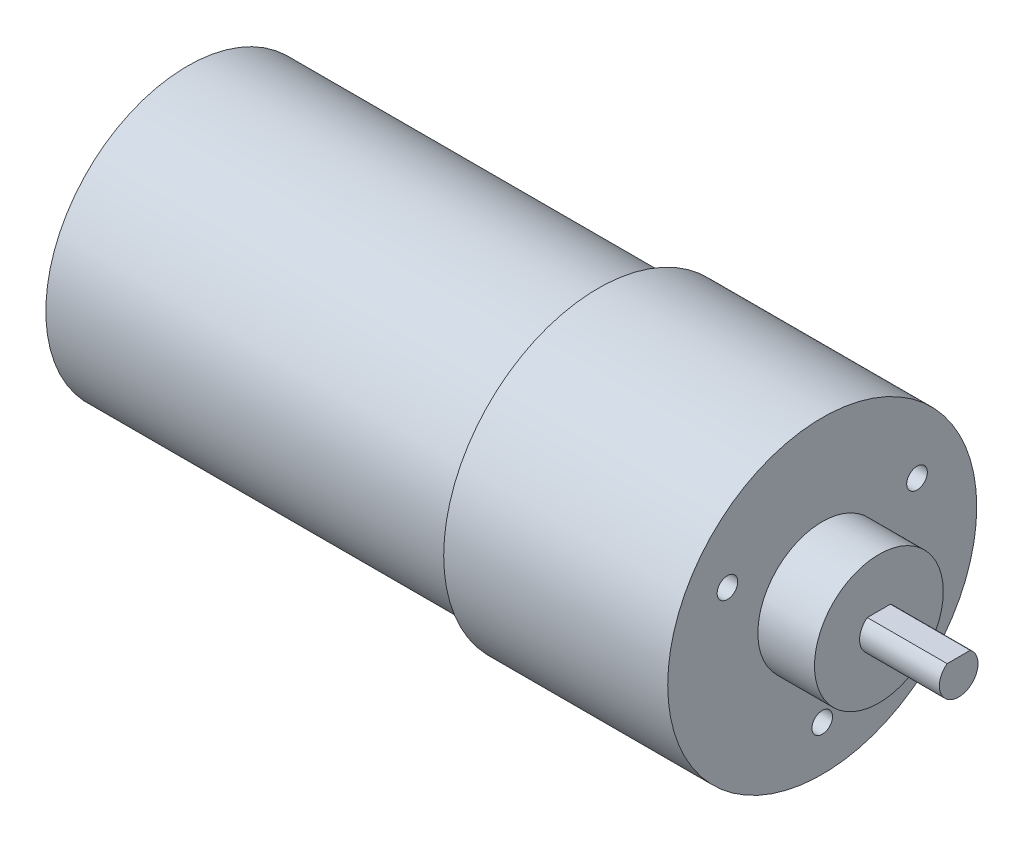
ISO-10303-21;
HEADER;
FILE_DESCRIPTION(('STEP AP214'),'2;1');
FILE_NAME('part.step','',(''),(''),'','','');
FILE_SCHEMA(('AUTOMOTIVE_DESIGN { 1 0 10303 214 1 1 1 1 }'));
ENDSEC;
DATA;
#1=APPLICATION_CONTEXT('core data for automotive mechanical design processes');
#2=APPLICATION_PROTOCOL_DEFINITION('international standard','automotive_design',2000,#1);
#3=PRODUCT_CONTEXT('',#1,'mechanical');
#4=PRODUCT('Part','Part','',(#3));
#5=PRODUCT_RELATED_PRODUCT_CATEGORY('part','',(#4));
#6=PRODUCT_DEFINITION_FORMATION('','',#4);
#7=PRODUCT_DEFINITION_CONTEXT('part definition',#1,'design');
#8=PRODUCT_DEFINITION('design','',#6,#7);
#9=PRODUCT_DEFINITION_SHAPE('','',#8);
#10=(LENGTH_UNIT() NAMED_UNIT(*) SI_UNIT(.MILLI.,.METRE.));
#11=(NAMED_UNIT(*) PLANE_ANGLE_UNIT() SI_UNIT($,.RADIAN.));
#12=(NAMED_UNIT(*) SI_UNIT($,.STERADIAN.) SOLID_ANGLE_UNIT());
#13=UNCERTAINTY_MEASURE_WITH_UNIT(LENGTH_MEASURE(1.E-05),#10,'distance_accuracy_value','');
#14=(GEOMETRIC_REPRESENTATION_CONTEXT(3) GLOBAL_UNCERTAINTY_ASSIGNED_CONTEXT((#13)) GLOBAL_UNIT_ASSIGNED_CONTEXT((#10,
#11,#12)) REPRESENTATION_CONTEXT('',''));
#15=CARTESIAN_POINT('',(0.,0.,0.));
#16=DIRECTION('',(0.,0.,1.));
#17=DIRECTION('',(1.,0.,0.));
#18=AXIS2_PLACEMENT_3D('',#15,#16,#17);
#19=CARTESIAN_POINT('',(53.7,0.,0.));
#20=DIRECTION('',(1.,0.,0.));
#21=DIRECTION('',(0.,0.,-1.));
#22=AXIS2_PLACEMENT_3D('',#19,#20,#21);
#23=PLANE('',#22);
#24=CARTESIAN_POINT('',(53.7,0.,0.));
#25=DIRECTION('',(1.,0.,0.));
#26=DIRECTION('',(0.,0.,-1.));
#27=AXIS2_PLACEMENT_3D('',#24,#25,#26);
#28=CIRCLE('',#27,5.);
#29=CARTESIAN_POINT('',(53.7,0.,-5.));
#30=VERTEX_POINT('',#29);
#31=EDGE_CURVE('E81',#30,#30,#28,.T.);
#32=ORIENTED_EDGE('',*,*,#31,.T.);
#33=EDGE_LOOP('',(#32));
#34=FACE_BOUND('',#33,.T.);
#35=DIRECTION('',(0.,0.,1.));
#36=VECTOR('',#35,1.);
#37=CARTESIAN_POINT('',(53.7,1.2,0.9));
#38=LINE('',#37,#36);
#39=CARTESIAN_POINT('',(53.7,1.2,-0.9));
#40=VERTEX_POINT('',#39);
#41=CARTESIAN_POINT('',(53.7,1.2,0.9));
#42=VERTEX_POINT('',#41);
#43=EDGE_CURVE('E61',#40,#42,#38,.T.);
#44=ORIENTED_EDGE('',*,*,#43,.F.);
#45=CARTESIAN_POINT('',(53.7,0.,0.));
#46=DIRECTION('',(1.,0.,0.));
#47=DIRECTION('',(0.,0.,-1.));
#48=AXIS2_PLACEMENT_3D('',#45,#46,#47);
#49=CIRCLE('',#48,1.5);
#50=EDGE_CURVE('E46',#42,#40,#49,.T.);
#51=ORIENTED_EDGE('',*,*,#50,.F.);
#52=EDGE_LOOP('',(#44,#51));
#53=FACE_BOUND('',#52,.T.);
#54=ADVANCED_FACE('F31',(#34,#53),#23,.T.);
#55=CARTESIAN_POINT('',(49.3,0.,0.));
#56=DIRECTION('',(1.,0.,0.));
#57=DIRECTION('',(0.,0.,-1.));
#58=AXIS2_PLACEMENT_3D('',#55,#56,#57);
#59=PLANE('',#58);
#60=CARTESIAN_POINT('',(49.3,4.24999999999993,-7.36121593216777));
#61=DIRECTION('',(1.,0.,0.));
#62=DIRECTION('',(0.,0.,-1.));
#63=AXIS2_PLACEMENT_3D('',#60,#61,#62);
#64=CIRCLE('',#63,0.8);
#65=CARTESIAN_POINT('',(49.3,4.24999999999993,-8.16121593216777));
#66=VERTEX_POINT('',#65);
#67=EDGE_CURVE('E258',#66,#66,#64,.T.);
#68=ORIENTED_EDGE('',*,*,#67,.F.);
#69=EDGE_LOOP('',(#68));
#70=FACE_BOUND('',#69,.T.);
#71=CARTESIAN_POINT('',(49.3,4.25000000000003,7.36121593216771));
#72=DIRECTION('',(1.,0.,0.));
#73=DIRECTION('',(0.,0.,-1.));
#74=AXIS2_PLACEMENT_3D('',#71,#72,#73);
#75=CIRCLE('',#74,0.8);
#76=CARTESIAN_POINT('',(49.3,4.25000000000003,6.56121593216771));
#77=VERTEX_POINT('',#76);
#78=EDGE_CURVE('E257',#77,#77,#75,.T.);
#79=ORIENTED_EDGE('',*,*,#78,.F.);
#80=EDGE_LOOP('',(#79));
#81=FACE_BOUND('',#80,.T.);
#82=CARTESIAN_POINT('',(49.3,-8.5,0.));
#83=DIRECTION('',(1.,0.,0.));
#84=DIRECTION('',(0.,0.,-1.));
#85=AXIS2_PLACEMENT_3D('',#82,#83,#84);
#86=CIRCLE('',#85,0.8);
#87=CARTESIAN_POINT('',(49.3,-8.5,-0.8));
#88=VERTEX_POINT('',#87);
#89=EDGE_CURVE('E74',#88,#88,#86,.T.);
#90=ORIENTED_EDGE('',*,*,#89,.F.);
#91=EDGE_LOOP('',(#90));
#92=FACE_BOUND('',#91,.T.);
#93=CARTESIAN_POINT('',(49.3,0.,0.));
#94=DIRECTION('',(1.,0.,0.));
#95=DIRECTION('',(0.,0.,-1.));
#96=AXIS2_PLACEMENT_3D('',#93,#94,#95);
#97=CIRCLE('',#96,12.);
#98=CARTESIAN_POINT('',(49.3,0.,-12.));
#99=VERTEX_POINT('',#98);
#100=EDGE_CURVE('E87',#99,#99,#97,.T.);
#101=ORIENTED_EDGE('',*,*,#100,.T.);
#102=EDGE_LOOP('',(#101));
#103=FACE_BOUND('',#102,.T.);
#104=CARTESIAN_POINT('',(49.3,0.,0.));
#105=DIRECTION('',(1.,0.,0.));
#106=DIRECTION('',(0.,0.,-1.));
#107=AXIS2_PLACEMENT_3D('',#104,#105,#106);
#108=CIRCLE('',#107,5.);
#109=CARTESIAN_POINT('',(49.3,0.,-5.));
#110=VERTEX_POINT('',#109);
#111=EDGE_CURVE('E80',#110,#110,#108,.T.);
#112=ORIENTED_EDGE('',*,*,#111,.F.);
#113=EDGE_LOOP('',(#112));
#114=FACE_BOUND('',#113,.T.);
#115=ADVANCED_FACE('F104',(#70,#81,#92,#103,#114),#59,.T.);
#116=CARTESIAN_POINT('',(31.9,0.,0.));
#117=DIRECTION('',(-1.,0.,0.));
#118=DIRECTION('',(0.,0.,1.));
#119=AXIS2_PLACEMENT_3D('',#116,#117,#118);
#120=CYLINDRICAL_SURFACE('',#119,11.);
#121=CARTESIAN_POINT('',(31.9,0.,0.));
#122=DIRECTION('',(1.,0.,0.));
#123=DIRECTION('',(0.,0.,-1.));
#124=AXIS2_PLACEMENT_3D('',#121,#122,#123);
#125=CIRCLE('',#124,11.);
#126=CARTESIAN_POINT('',(31.9,0.,-11.));
#127=VERTEX_POINT('',#126);
#128=EDGE_CURVE('E11',#127,#127,#125,.T.);
#129=ORIENTED_EDGE('',*,*,#128,.F.);
#130=EDGE_LOOP('',(#129));
#131=FACE_BOUND('',#130,.T.);
#132=CARTESIAN_POINT('',(0.,0.,0.));
#133=DIRECTION('',(1.,0.,0.));
#134=DIRECTION('',(0.,0.,-1.));
#135=AXIS2_PLACEMENT_3D('',#132,#133,#134);
#136=CIRCLE('',#135,11.);
#137=CARTESIAN_POINT('',(0.,0.,-11.));
#138=VERTEX_POINT('',#137);
#139=EDGE_CURVE('E35',#138,#138,#136,.T.);
#140=ORIENTED_EDGE('',*,*,#139,.T.);
#141=EDGE_LOOP('',(#140));
#142=FACE_BOUND('',#141,.T.);
#143=ADVANCED_FACE('F33',(#131,#142),#120,.T.);
#144=CARTESIAN_POINT('',(0.,0.,0.));
#145=DIRECTION('',(1.,0.,0.));
#146=DIRECTION('',(0.,0.,-1.));
#147=AXIS2_PLACEMENT_3D('',#144,#145,#146);
#148=PLANE('',#147);
#149=ORIENTED_EDGE('',*,*,#139,.F.);
#150=EDGE_LOOP('',(#149));
#151=FACE_BOUND('',#150,.T.);
#152=ADVANCED_FACE('F98',(#151),#148,.F.);
#153=CARTESIAN_POINT('',(31.9,0.,0.));
#154=DIRECTION('',(1.,0.,0.));
#155=DIRECTION('',(0.,0.,-1.));
#156=AXIS2_PLACEMENT_3D('',#153,#154,#155);
#157=PLANE('',#156);
#158=CARTESIAN_POINT('',(31.9,0.,0.));
#159=DIRECTION('',(1.,0.,0.));
#160=DIRECTION('',(0.,0.,-1.));
#161=AXIS2_PLACEMENT_3D('',#158,#159,#160);
#162=CIRCLE('',#161,12.);
#163=CARTESIAN_POINT('',(31.9,0.,-12.));
#164=VERTEX_POINT('',#163);
#165=EDGE_CURVE('E84',#164,#164,#162,.T.);
#166=ORIENTED_EDGE('',*,*,#165,.F.);
#167=EDGE_LOOP('',(#166));
#168=FACE_BOUND('',#167,.T.);
#169=ORIENTED_EDGE('',*,*,#128,.T.);
#170=EDGE_LOOP('',(#169));
#171=FACE_BOUND('',#170,.T.);
#172=ADVANCED_FACE('F95',(#168,#171),#157,.F.);
#173=CARTESIAN_POINT('',(49.3,0.,0.));
#174=DIRECTION('',(-1.,0.,0.));
#175=DIRECTION('',(0.,0.,1.));
#176=AXIS2_PLACEMENT_3D('',#173,#174,#175);
#177=CYLINDRICAL_SURFACE('',#176,12.);
#178=ORIENTED_EDGE('',*,*,#100,.F.);
#179=EDGE_LOOP('',(#178));
#180=FACE_BOUND('',#179,.T.);
#181=ORIENTED_EDGE('',*,*,#165,.T.);
#182=EDGE_LOOP('',(#181));
#183=FACE_BOUND('',#182,.T.);
#184=ADVANCED_FACE('F93',(#180,#183),#177,.T.);
#185=CARTESIAN_POINT('',(53.7,0.,0.));
#186=DIRECTION('',(-1.,0.,0.));
#187=DIRECTION('',(0.,0.,1.));
#188=AXIS2_PLACEMENT_3D('',#185,#186,#187);
#189=CYLINDRICAL_SURFACE('',#188,5.);
#190=ORIENTED_EDGE('',*,*,#31,.F.);
#191=EDGE_LOOP('',(#190));
#192=FACE_BOUND('',#191,.T.);
#193=ORIENTED_EDGE('',*,*,#111,.T.);
#194=EDGE_LOOP('',(#193));
#195=FACE_BOUND('',#194,.T.);
#196=ADVANCED_FACE('F123',(#192,#195),#189,.T.);
#197=CARTESIAN_POINT('',(59.9,0.,0.));
#198=DIRECTION('',(-1.,0.,0.));
#199=DIRECTION('',(0.,0.,1.));
#200=AXIS2_PLACEMENT_3D('',#197,#198,#199);
#201=CYLINDRICAL_SURFACE('',#200,1.5);
#202=ORIENTED_EDGE('',*,*,#50,.T.);
#203=DIRECTION('',(-1.,0.,0.));
#204=VECTOR('',#203,1.);
#205=CARTESIAN_POINT('',(59.9,1.2,-0.9));
#206=LINE('',#205,#204);
#207=CARTESIAN_POINT('',(59.9,1.2,-0.9));
#208=VERTEX_POINT('',#207);
#209=EDGE_CURVE('E65',#208,#40,#206,.T.);
#210=ORIENTED_EDGE('',*,*,#209,.F.);
#211=CARTESIAN_POINT('',(59.9,0.,0.));
#212=DIRECTION('',(1.,0.,0.));
#213=DIRECTION('',(0.,0.,-1.));
#214=AXIS2_PLACEMENT_3D('',#211,#212,#213);
#215=CIRCLE('',#214,1.5);
#216=CARTESIAN_POINT('',(59.9,1.2,0.9));
#217=VERTEX_POINT('',#216);
#218=EDGE_CURVE('E67',#217,#208,#215,.T.);
#219=ORIENTED_EDGE('',*,*,#218,.F.);
#220=DIRECTION('',(-1.,0.,0.));
#221=VECTOR('',#220,1.);
#222=CARTESIAN_POINT('',(59.9,1.2,0.9));
#223=LINE('',#222,#221);
#224=EDGE_CURVE('E63',#217,#42,#223,.T.);
#225=ORIENTED_EDGE('',*,*,#224,.T.);
#226=EDGE_LOOP('',(#202,#210,#219,#225));
#227=FACE_BOUND('',#226,.T.);
#228=ADVANCED_FACE('F69',(#227),#201,.T.);
#229=CARTESIAN_POINT('',(59.9,1.2,0.9));
#230=DIRECTION('',(0.,-1.,0.));
#231=DIRECTION('',(0.,0.,-1.));
#232=AXIS2_PLACEMENT_3D('',#229,#230,#231);
#233=PLANE('',#232);
#234=ORIENTED_EDGE('',*,*,#43,.T.);
#235=ORIENTED_EDGE('',*,*,#224,.F.);
#236=DIRECTION('',(0.,0.,1.));
#237=VECTOR('',#236,1.);
#238=CARTESIAN_POINT('',(59.9,1.2,0.9));
#239=LINE('',#238,#237);
#240=EDGE_CURVE('E54',#208,#217,#239,.T.);
#241=ORIENTED_EDGE('',*,*,#240,.F.);
#242=ORIENTED_EDGE('',*,*,#209,.T.);
#243=EDGE_LOOP('',(#234,#235,#241,#242));
#244=FACE_BOUND('',#243,.T.);
#245=ADVANCED_FACE('F62',(#244),#233,.F.);
#246=CARTESIAN_POINT('',(59.9,0.,0.));
#247=DIRECTION('',(1.,0.,0.));
#248=DIRECTION('',(0.,0.,-1.));
#249=AXIS2_PLACEMENT_3D('',#246,#247,#248);
#250=PLANE('',#249);
#251=ORIENTED_EDGE('',*,*,#218,.T.);
#252=ORIENTED_EDGE('',*,*,#240,.T.);
#253=EDGE_LOOP('',(#251,#252));
#254=FACE_BOUND('',#253,.T.);
#255=ADVANCED_FACE('F152',(#254),#250,.T.);
#256=CARTESIAN_POINT('',(47.8,-8.5,0.));
#257=DIRECTION('',(1.,0.,0.));
#258=DIRECTION('',(0.,0.,-1.));
#259=AXIS2_PLACEMENT_3D('',#256,#257,#258);
#260=CYLINDRICAL_SURFACE('',#259,0.8);
#261=CARTESIAN_POINT('',(47.8,-8.5,0.));
#262=DIRECTION('',(1.,0.,0.));
#263=DIRECTION('',(0.,0.,-1.));
#264=AXIS2_PLACEMENT_3D('',#261,#262,#263);
#265=CIRCLE('',#264,0.8);
#266=CARTESIAN_POINT('',(47.8,-8.5,-0.8));
#267=VERTEX_POINT('',#266);
#268=EDGE_CURVE('E71',#267,#267,#265,.T.);
#269=ORIENTED_EDGE('',*,*,#268,.F.);
#270=EDGE_LOOP('',(#269));
#271=FACE_BOUND('',#270,.T.);
#272=ORIENTED_EDGE('',*,*,#89,.T.);
#273=EDGE_LOOP('',(#272));
#274=FACE_BOUND('',#273,.T.);
#275=ADVANCED_FACE('F158',(#271,#274),#260,.F.);
#276=CARTESIAN_POINT('',(47.8,-8.5,0.));
#277=DIRECTION('',(1.,0.,0.));
#278=DIRECTION('',(0.,0.,-1.));
#279=AXIS2_PLACEMENT_3D('',#276,#277,#278);
#280=PLANE('',#279);
#281=ORIENTED_EDGE('',*,*,#268,.T.);
#282=EDGE_LOOP('',(#281));
#283=FACE_BOUND('',#282,.T.);
#284=ADVANCED_FACE('F166',(#283),#280,.T.);
#285=CARTESIAN_POINT('',(47.8,4.25000000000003,7.36121593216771));
#286=DIRECTION('',(1.,0.,0.));
#287=DIRECTION('',(0.,0.,-1.));
#288=AXIS2_PLACEMENT_3D('',#285,#286,#287);
#289=CYLINDRICAL_SURFACE('',#288,0.8);
#290=CARTESIAN_POINT('',(47.8,4.25000000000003,7.36121593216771));
#291=DIRECTION('',(1.,0.,0.));
#292=DIRECTION('',(0.,0.,-1.));
#293=AXIS2_PLACEMENT_3D('',#290,#291,#292);
#294=CIRCLE('',#293,0.8);
#295=CARTESIAN_POINT('',(47.8,4.25000000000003,6.56121593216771));
#296=VERTEX_POINT('',#295);
#297=EDGE_CURVE('E261',#296,#296,#294,.T.);
#298=ORIENTED_EDGE('',*,*,#297,.F.);
#299=EDGE_LOOP('',(#298));
#300=FACE_BOUND('',#299,.T.);
#301=ORIENTED_EDGE('',*,*,#78,.T.);
#302=EDGE_LOOP('',(#301));
#303=FACE_BOUND('',#302,.T.);
#304=ADVANCED_FACE('F174',(#300,#303),#289,.F.);
#305=CARTESIAN_POINT('',(47.8,4.25000000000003,7.36121593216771));
#306=DIRECTION('',(1.,0.,0.));
#307=DIRECTION('',(0.,0.,-1.));
#308=AXIS2_PLACEMENT_3D('',#305,#306,#307);
#309=PLANE('',#308);
#310=ORIENTED_EDGE('',*,*,#297,.T.);
#311=EDGE_LOOP('',(#310));
#312=FACE_BOUND('',#311,.T.);
#313=ADVANCED_FACE('F182',(#312),#309,.T.);
#314=CARTESIAN_POINT('',(47.8,4.24999999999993,-7.36121593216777));
#315=DIRECTION('',(1.,0.,0.));
#316=DIRECTION('',(0.,0.,-1.));
#317=AXIS2_PLACEMENT_3D('',#314,#315,#316);
#318=CYLINDRICAL_SURFACE('',#317,0.8);
#319=CARTESIAN_POINT('',(47.8,4.24999999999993,-7.36121593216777));
#320=DIRECTION('',(1.,0.,0.));
#321=DIRECTION('',(0.,0.,-1.));
#322=AXIS2_PLACEMENT_3D('',#319,#320,#321);
#323=CIRCLE('',#322,0.8);
#324=CARTESIAN_POINT('',(47.8,4.24999999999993,-8.16121593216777));
#325=VERTEX_POINT('',#324);
#326=EDGE_CURVE('E256',#325,#325,#323,.T.);
#327=ORIENTED_EDGE('',*,*,#326,.F.);
#328=EDGE_LOOP('',(#327));
#329=FACE_BOUND('',#328,.T.);
#330=ORIENTED_EDGE('',*,*,#67,.T.);
#331=EDGE_LOOP('',(#330));
#332=FACE_BOUND('',#331,.T.);
#333=ADVANCED_FACE('F190',(#329,#332),#318,.F.);
#334=CARTESIAN_POINT('',(47.8,4.24999999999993,-7.36121593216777));
#335=DIRECTION('',(1.,0.,0.));
#336=DIRECTION('',(0.,0.,-1.));
#337=AXIS2_PLACEMENT_3D('',#334,#335,#336);
#338=PLANE('',#337);
#339=ORIENTED_EDGE('',*,*,#326,.T.);
#340=EDGE_LOOP('',(#339));
#341=FACE_BOUND('',#340,.T.);
#342=ADVANCED_FACE('F198',(#341),#338,.T.);
#343=CLOSED_SHELL('',(#54,#115,#143,#152,#172,#184,#196,#228,#245,#255,#275,#284,#304,#313,#333,#342));
#344=MANIFOLD_SOLID_BREP('B2',#343);
#345=ADVANCED_BREP_SHAPE_REPRESENTATION('',(#18,#344),#14);
#346=SHAPE_DEFINITION_REPRESENTATION(#9,#345);
ENDSEC;
END-ISO-10303-21;
